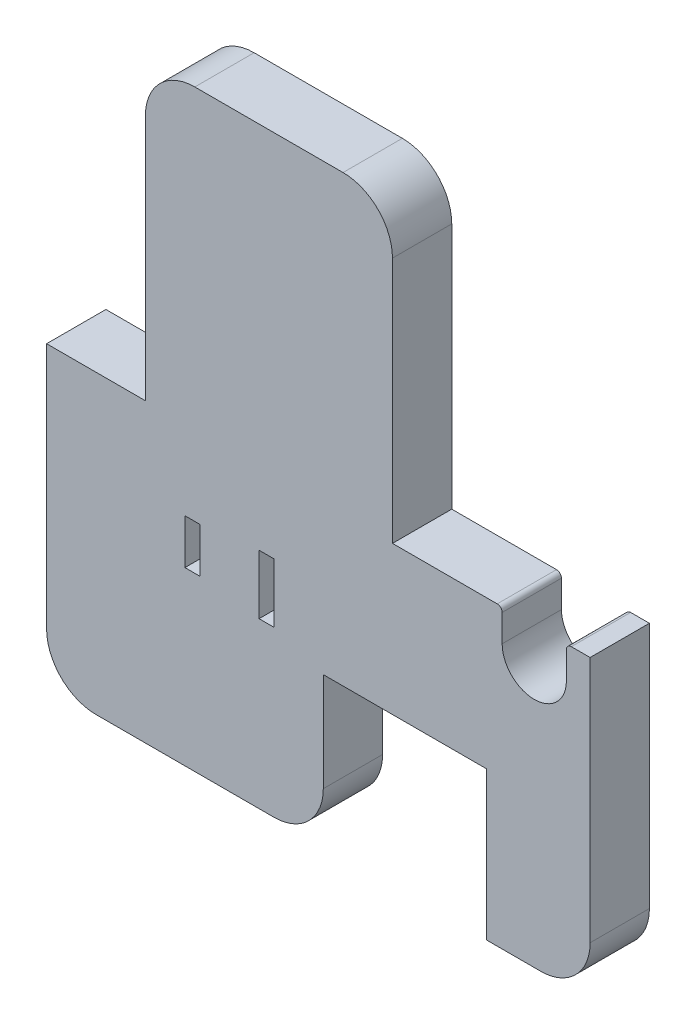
from build123d import *

# Parameters (mm, degrees)
SKETCH1_W           = 3
SKETCH1_H           = 9.09
SKETCH1_H_2         = 12
BOSS_EXTRUDE1_DEPTH = 12
FILLET1_R           = 10
FILLET2_R           = 10
CUT_EXTRUDE1_DEPTH  = 25
FILLET3_R           = 1


with BuildPart() as part:
    # Sketch1 → Boss-Extrude1 (new body)
    with BuildSketch(Plane.XY):
        Polygon((-45, 30), (-45, -30), (11, -30), (11, 0), (44, 0), (44, -30), (65, -30), (65, 30), (25, 30), (25, 90), (-25, 90), (-25, 30), align=None)
        with Locations((-15.5, 9.3)):
            Rectangle(SKETCH1_W, SKETCH1_H, mode=Mode.SUBTRACT)
        with Locations((-0.5, 9.3)):
            Rectangle(SKETCH1_W, SKETCH1_H_2, mode=Mode.SUBTRACT)
    extrude(amount=-BOSS_EXTRUDE1_DEPTH)

    # Fillet1
    fillet1_edges = [part.edges().sort_by_distance(p)[0] for p in [
        (-25, 90, -6),
        (25, 90, -6),
        (65, -30, -6),
        (-45, -30, -6),
    ]]
    fillet(fillet1_edges, radius=FILLET1_R)

    # Fillet2
    fillet2_edges = [part.edges().sort_by_distance(p)[0] for p in [
        (11, -30, -6),
    ]]
    fillet(fillet2_edges, radius=FILLET2_R)

    # Sketch2 → Cut-Extrude1 (cut)
    with BuildSketch(Plane.XY):
        with BuildLine():
            Line((60.2, 23.5), (60.2, 30))
            Line((60.2, 30), (47.2, 30))
            Line((47.2, 30), (47.2, 23.5))
            ThreePointArc((47.2, 23.5), (53.7, 17), (60.2, 23.5))
        make_face()
    extrude(amount=-CUT_EXTRUDE1_DEPTH, mode=Mode.SUBTRACT)

    # Fillet3
    fillet3_edges = [part.edges().sort_by_distance(p)[0] for p in [
        (47.2, 30, -6),
        (60.2, 30, -6),
    ]]
    fillet(fillet3_edges, radius=FILLET3_R)


solid = part.part
